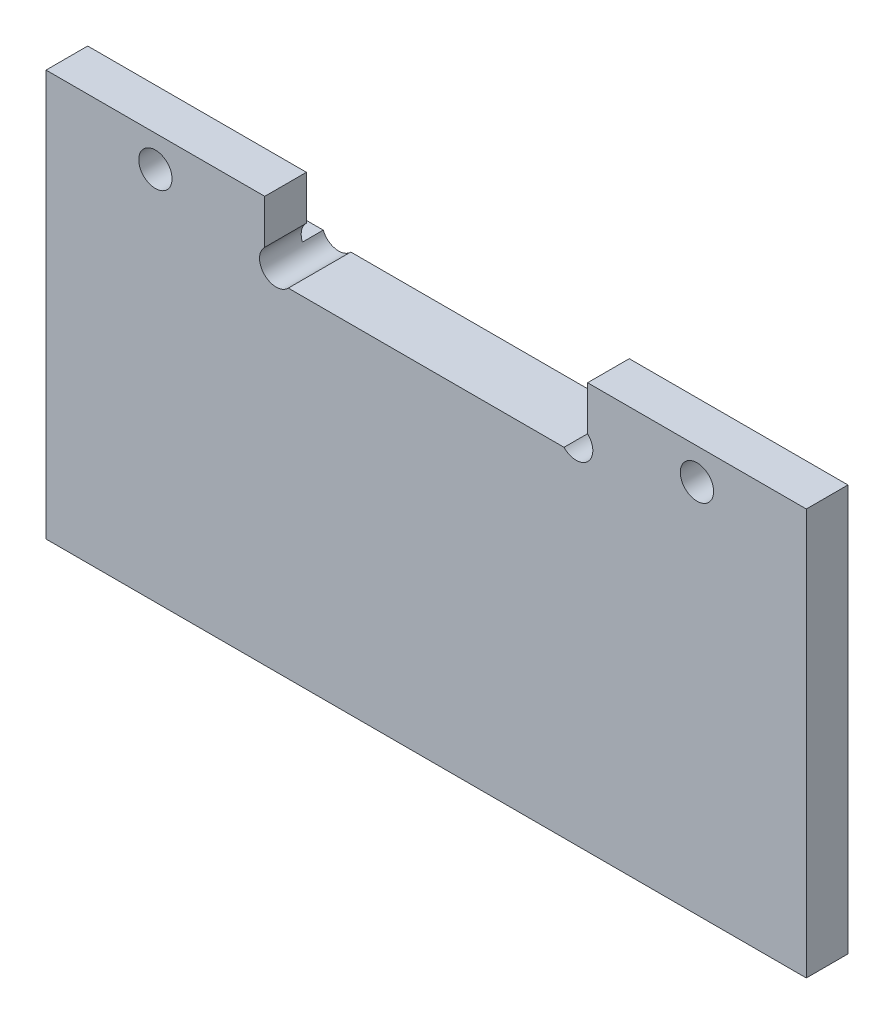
from build123d import *

# Parameters (mm, degrees)
ESQUISSE1_W             = 73
ESQUISSE1_H             = 39
EXTRUSION1_DEPTH        = 6
ESQUISSE2_W             = 31
ESQUISSE2_H             = 6.5
ENL_V_MAT_EXTRU_1_DEPTH = 6
ESQUISSE3_W             = 23
ESQUISSE3_H             = 6
ESQUISSE3_W_2           = 30
ENL_V_MAT_EXTRU_2_DEPTH = 2
ESQUISSE4_R             = 1.6
ENL_V_MAT_EXTRU_3_DEPTH = 57.885850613
ENL_V_MAT_EXTRU_4_DEPTH = 2


with BuildPart() as part:
    # Esquisse1 → Extrusion1 (new body)
    with BuildSketch(Plane.XY):
        with Locations((-3.5, 20.5)):
            Rectangle(ESQUISSE1_W, ESQUISSE1_H)
    extrude(amount=EXTRUSION1_DEPTH)

    # Esquisse2 → Enl_v. mat.-Extru.1 (cut)
    with BuildSketch(Plane.XY.offset(6)):
        with Locations((-3.5, 36.75)):
            Rectangle(ESQUISSE2_W, ESQUISSE2_H)
    extrude(amount=-ENL_V_MAT_EXTRU_1_DEPTH, mode=Mode.SUBTRACT)

    # Esquisse3 → Enl_v. mat.-Extru.2 (cut)
    with BuildSketch(Plane(origin=(0, 0, 0), x_dir=(-1, 0, 0), z_dir=(0, 0, -1))):
        with Locations((-21.5, 37)):
            Rectangle(ESQUISSE3_W, ESQUISSE3_H)
        with Locations((25, 37)):
            Rectangle(ESQUISSE3_W_2, ESQUISSE3_H)
    extrude(amount=-ENL_V_MAT_EXTRU_2_DEPTH, mode=Mode.SUBTRACT)

    # Esquisse4 → Enl_v. mat.-Extru.3 (cut, through all)
    with BuildSketch(Plane.XY.offset(6)):
        with Locations((22.5, 37)):
            Circle(ESQUISSE4_R)
        with Locations((-29.5, 37)):
            Circle(ESQUISSE4_R)
        with Locations((-17.9, 34.6)):
            Circle(ESQUISSE4_R)
        with Locations((10.9, 34.6)):
            Circle(ESQUISSE4_R)
    extrude(amount=-ENL_V_MAT_EXTRU_3_DEPTH, mode=Mode.SUBTRACT)

    # Esquisse5 → Enl_v. mat.-Extru.4 (cut)
    with BuildSketch(Plane(origin=(0, 0, 0), x_dir=(-1, 0, 0), z_dir=(0, 0, -1))):
        Polygon((40, 1), (-33, 1), (-33, 4), (-33, 34), (-29.8, 34), (-29.8, 4.2), (36.8, 4.2), (36.8, 34), (40, 34), (40, 4.2), align=None)
    extrude(amount=-ENL_V_MAT_EXTRU_4_DEPTH, mode=Mode.SUBTRACT)


solid = part.part
